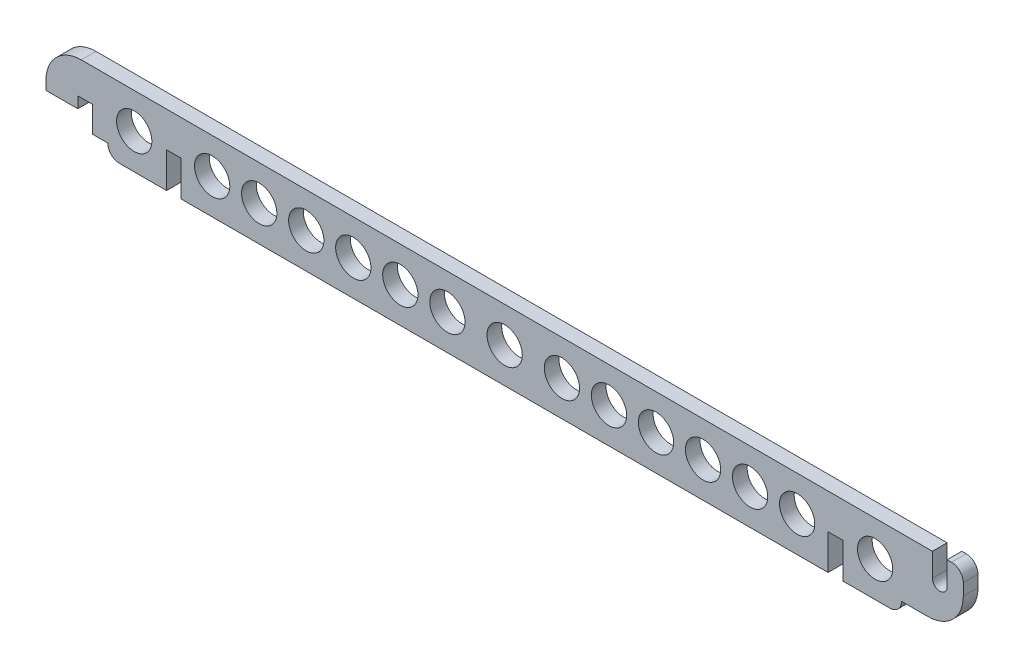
ISO-10303-21;
HEADER;
FILE_DESCRIPTION(('STEP AP214'),'2;1');
FILE_NAME('part.step','',(''),(''),'','','');
FILE_SCHEMA(('AUTOMOTIVE_DESIGN { 1 0 10303 214 1 1 1 1 }'));
ENDSEC;
DATA;
#1=APPLICATION_CONTEXT('core data for automotive mechanical design processes');
#2=APPLICATION_PROTOCOL_DEFINITION('international standard','automotive_design',2000,#1);
#3=PRODUCT_CONTEXT('',#1,'mechanical');
#4=PRODUCT('Part','Part','',(#3));
#5=PRODUCT_RELATED_PRODUCT_CATEGORY('part','',(#4));
#6=PRODUCT_DEFINITION_FORMATION('','',#4);
#7=PRODUCT_DEFINITION_CONTEXT('part definition',#1,'design');
#8=PRODUCT_DEFINITION('design','',#6,#7);
#9=PRODUCT_DEFINITION_SHAPE('','',#8);
#10=(LENGTH_UNIT() NAMED_UNIT(*) SI_UNIT(.MILLI.,.METRE.));
#11=(NAMED_UNIT(*) PLANE_ANGLE_UNIT() SI_UNIT($,.RADIAN.));
#12=(NAMED_UNIT(*) SI_UNIT($,.STERADIAN.) SOLID_ANGLE_UNIT());
#13=UNCERTAINTY_MEASURE_WITH_UNIT(LENGTH_MEASURE(1.E-05),#10,'distance_accuracy_value','');
#14=(GEOMETRIC_REPRESENTATION_CONTEXT(3) GLOBAL_UNCERTAINTY_ASSIGNED_CONTEXT((#13)) GLOBAL_UNIT_ASSIGNED_CONTEXT((#10,
#11,#12)) REPRESENTATION_CONTEXT('',''));
#15=CARTESIAN_POINT('',(0.,0.,0.));
#16=DIRECTION('',(0.,0.,1.));
#17=DIRECTION('',(1.,0.,0.));
#18=AXIS2_PLACEMENT_3D('',#15,#16,#17);
#19=CARTESIAN_POINT('',(-177.025859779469,26.2786282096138,3.175));
#20=DIRECTION('',(0.,0.,1.));
#21=DIRECTION('',(1.,0.,0.));
#22=AXIS2_PLACEMENT_3D('',#19,#20,#21);
#23=PLANE('',#22);
#24=CARTESIAN_POINT('',(-5.57602117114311,26.2786282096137,3.175));
#25=DIRECTION('',(0.,0.,1.));
#26=DIRECTION('',(-1.,0.,0.));
#27=AXIS2_PLACEMENT_3D('',#24,#25,#26);
#28=CIRCLE('',#27,3.81000000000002);
#29=CARTESIAN_POINT('',(-9.38602117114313,26.2786282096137,3.175));
#30=VERTEX_POINT('',#29);
#31=EDGE_CURVE('E529',#30,#30,#28,.T.);
#32=ORIENTED_EDGE('',*,*,#31,.F.);
#33=EDGE_LOOP('',(#32));
#34=FACE_BOUND('',#33,.T.);
#35=CARTESIAN_POINT('',(-32.574572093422,26.2786282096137,3.175));
#36=DIRECTION('',(0.,0.,1.));
#37=DIRECTION('',(-1.,0.,0.));
#38=AXIS2_PLACEMENT_3D('',#35,#36,#37);
#39=CIRCLE('',#38,3.81000000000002);
#40=CARTESIAN_POINT('',(-36.384572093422,26.2786282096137,3.175));
#41=VERTEX_POINT('',#40);
#42=EDGE_CURVE('E541',#41,#41,#39,.T.);
#43=ORIENTED_EDGE('',*,*,#42,.F.);
#44=EDGE_LOOP('',(#43));
#45=FACE_BOUND('',#44,.T.);
#46=CARTESIAN_POINT('',(-52.894572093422,26.2786282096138,3.175));
#47=DIRECTION('',(0.,0.,1.));
#48=DIRECTION('',(-1.,0.,0.));
#49=AXIS2_PLACEMENT_3D('',#46,#47,#48);
#50=CIRCLE('',#49,3.81);
#51=CARTESIAN_POINT('',(-56.704572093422,26.2786282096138,3.175));
#52=VERTEX_POINT('',#51);
#53=EDGE_CURVE('E553',#52,#52,#50,.T.);
#54=ORIENTED_EDGE('',*,*,#53,.F.);
#55=EDGE_LOOP('',(#54));
#56=FACE_BOUND('',#55,.T.);
#57=CARTESIAN_POINT('',(-97.9571474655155,26.2786282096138,3.175));
#58=DIRECTION('',(0.,0.,1.));
#59=DIRECTION('',(1.,0.,0.));
#60=AXIS2_PLACEMENT_3D('',#57,#58,#59);
#61=CIRCLE('',#60,3.81);
#62=CARTESIAN_POINT('',(-94.1471474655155,26.2786282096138,3.175));
#63=VERTEX_POINT('',#62);
#64=EDGE_CURVE('E565',#63,#63,#61,.T.);
#65=ORIENTED_EDGE('',*,*,#64,.F.);
#66=EDGE_LOOP('',(#65));
#67=FACE_BOUND('',#66,.T.);
#68=CARTESIAN_POINT('',(-118.277147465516,26.2786282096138,3.175));
#69=DIRECTION('',(0.,0.,1.));
#70=DIRECTION('',(1.,0.,0.));
#71=AXIS2_PLACEMENT_3D('',#68,#69,#70);
#72=CIRCLE('',#71,3.80999999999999);
#73=CARTESIAN_POINT('',(-114.467147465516,26.2786282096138,3.175));
#74=VERTEX_POINT('',#73);
#75=EDGE_CURVE('E577',#74,#74,#72,.T.);
#76=ORIENTED_EDGE('',*,*,#75,.F.);
#77=EDGE_LOOP('',(#76));
#78=FACE_BOUND('',#77,.T.);
#79=CARTESIAN_POINT('',(-138.597147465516,26.2786282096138,3.175));
#80=DIRECTION('',(0.,0.,1.));
#81=DIRECTION('',(1.,0.,0.));
#82=AXIS2_PLACEMENT_3D('',#79,#80,#81);
#83=CIRCLE('',#82,3.81000000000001);
#84=CARTESIAN_POINT('',(-134.787147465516,26.2786282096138,3.175));
#85=VERTEX_POINT('',#84);
#86=EDGE_CURVE('E589',#85,#85,#83,.T.);
#87=ORIENTED_EDGE('',*,*,#86,.F.);
#88=EDGE_LOOP('',(#87));
#89=FACE_BOUND('',#88,.T.);
#90=CARTESIAN_POINT('',(-73.214572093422,26.2786282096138,3.175));
#91=DIRECTION('',(0.,0.,1.));
#92=DIRECTION('',(-1.,0.,0.));
#93=AXIS2_PLACEMENT_3D('',#90,#91,#92);
#94=CIRCLE('',#93,3.81);
#95=CARTESIAN_POINT('',(-77.024572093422,26.2786282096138,3.175));
#96=VERTEX_POINT('',#95);
#97=EDGE_CURVE('E601',#96,#96,#94,.T.);
#98=ORIENTED_EDGE('',*,*,#97,.F.);
#99=EDGE_LOOP('',(#98));
#100=FACE_BOUND('',#99,.T.);
#101=CARTESIAN_POINT('',(-177.025859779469,26.2786282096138,3.175));
#102=DIRECTION('',(0.,0.,1.));
#103=DIRECTION('',(1.,0.,0.));
#104=AXIS2_PLACEMENT_3D('',#101,#102,#103);
#105=CIRCLE('',#104,7.61999999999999);
#106=CARTESIAN_POINT('',(-177.025859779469,33.8986282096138,3.175));
#107=VERTEX_POINT('',#106);
#108=CARTESIAN_POINT('',(-184.645859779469,26.2786282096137,3.175));
#109=VERTEX_POINT('',#108);
#110=EDGE_CURVE('E295',#107,#109,#105,.T.);
#111=ORIENTED_EDGE('',*,*,#110,.T.);
#112=DIRECTION('',(0.,-1.,0.));
#113=VECTOR('',#112,1.);
#114=CARTESIAN_POINT('',(-184.645859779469,24.3736282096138,3.175));
#115=LINE('',#114,#113);
#116=CARTESIAN_POINT('',(-184.645859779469,24.3736282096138,3.175));
#117=VERTEX_POINT('',#116);
#118=EDGE_CURVE('E148',#109,#117,#115,.T.);
#119=ORIENTED_EDGE('',*,*,#118,.T.);
#120=DIRECTION('',(1.,0.,0.));
#121=VECTOR('',#120,1.);
#122=CARTESIAN_POINT('',(-177.787859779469,24.3736282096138,3.175));
#123=LINE('',#122,#121);
#124=CARTESIAN_POINT('',(-177.787859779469,24.3736282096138,3.175));
#125=VERTEX_POINT('',#124);
#126=EDGE_CURVE('E367',#117,#125,#123,.T.);
#127=ORIENTED_EDGE('',*,*,#126,.T.);
#128=DIRECTION('',(0.,1.,0.));
#129=VECTOR('',#128,1.);
#130=CARTESIAN_POINT('',(-177.787859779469,24.3736282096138,3.175));
#131=LINE('',#130,#129);
#132=CARTESIAN_POINT('',(-177.787859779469,26.7990639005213,3.175));
#133=VERTEX_POINT('',#132);
#134=EDGE_CURVE('E386',#125,#133,#131,.T.);
#135=ORIENTED_EDGE('',*,*,#134,.T.);
#136=DIRECTION('',(1.,0.,0.));
#137=VECTOR('',#136,1.);
#138=CARTESIAN_POINT('',(-177.787859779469,26.7990639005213,3.175));
#139=LINE('',#138,#137);
#140=CARTESIAN_POINT('',(-174.612859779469,26.7990639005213,3.175));
#141=VERTEX_POINT('',#140);
#142=EDGE_CURVE('E383',#133,#141,#139,.T.);
#143=ORIENTED_EDGE('',*,*,#142,.T.);
#144=DIRECTION('',(0.,-1.,0.));
#145=VECTOR('',#144,1.);
#146=CARTESIAN_POINT('',(-174.612859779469,26.7990639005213,3.175));
#147=LINE('',#146,#145);
#148=CARTESIAN_POINT('',(-174.612859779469,21.1986282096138,3.175));
#149=VERTEX_POINT('',#148);
#150=EDGE_CURVE('E385',#141,#149,#147,.T.);
#151=ORIENTED_EDGE('',*,*,#150,.T.);
#152=DIRECTION('',(1.,0.,0.));
#153=VECTOR('',#152,1.);
#154=CARTESIAN_POINT('',(-171.310859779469,21.1986282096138,3.175));
#155=LINE('',#154,#153);
#156=CARTESIAN_POINT('',(-171.310859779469,21.1986282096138,3.175));
#157=VERTEX_POINT('',#156);
#158=EDGE_CURVE('E388',#149,#157,#155,.T.);
#159=ORIENTED_EDGE('',*,*,#158,.T.);
#160=CARTESIAN_POINT('',(-168.770859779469,21.1986282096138,3.175));
#161=DIRECTION('',(0.,0.,1.));
#162=DIRECTION('',(1.,0.,0.));
#163=AXIS2_PLACEMENT_3D('',#160,#161,#162);
#164=CIRCLE('',#163,2.53999999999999);
#165=CARTESIAN_POINT('',(-168.770859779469,18.6586282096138,3.175));
#166=VERTEX_POINT('',#165);
#167=EDGE_CURVE('E394',#157,#166,#164,.T.);
#168=ORIENTED_EDGE('',*,*,#167,.T.);
#169=DIRECTION('',(1.,0.,0.));
#170=VECTOR('',#169,1.);
#171=CARTESIAN_POINT('',(-158.610859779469,18.6586282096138,3.175));
#172=LINE('',#171,#170);
#173=CARTESIAN_POINT('',(-158.610859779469,18.6586282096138,3.175));
#174=VERTEX_POINT('',#173);
#175=EDGE_CURVE('E396',#166,#174,#172,.T.);
#176=ORIENTED_EDGE('',*,*,#175,.T.);
#177=DIRECTION('',(0.,1.,0.));
#178=VECTOR('',#177,1.);
#179=CARTESIAN_POINT('',(-158.610859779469,26.2786282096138,3.175));
#180=LINE('',#179,#178);
#181=CARTESIAN_POINT('',(-158.610859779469,26.2786282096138,3.175));
#182=VERTEX_POINT('',#181);
#183=EDGE_CURVE('E398',#174,#182,#180,.T.);
#184=ORIENTED_EDGE('',*,*,#183,.T.);
#185=DIRECTION('',(1.,0.,0.));
#186=VECTOR('',#185,1.);
#187=CARTESIAN_POINT('',(-155.435859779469,26.2786282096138,3.175));
#188=LINE('',#187,#186);
#189=CARTESIAN_POINT('',(-155.435859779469,26.2786282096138,3.175));
#190=VERTEX_POINT('',#189);
#191=EDGE_CURVE('E400',#182,#190,#188,.T.);
#192=ORIENTED_EDGE('',*,*,#191,.T.);
#193=DIRECTION('',(1.45698559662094E-13,-1.,0.));
#194=VECTOR('',#193,1.);
#195=CARTESIAN_POINT('',(-155.435859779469,26.2786282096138,3.175));
#196=LINE('',#195,#194);
#197=CARTESIAN_POINT('',(-155.435859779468,18.6586282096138,3.175));
#198=VERTEX_POINT('',#197);
#199=EDGE_CURVE('E402',#190,#198,#196,.T.);
#200=ORIENTED_EDGE('',*,*,#199,.T.);
#201=DIRECTION('',(1.,0.,0.));
#202=VECTOR('',#201,1.);
#203=CARTESIAN_POINT('',(-15.7358597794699,18.6586282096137,3.175));
#204=LINE('',#203,#202);
#205=CARTESIAN_POINT('',(-15.7358597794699,18.6586282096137,3.175));
#206=VERTEX_POINT('',#205);
#207=EDGE_CURVE('E404',#198,#206,#204,.T.);
#208=ORIENTED_EDGE('',*,*,#207,.T.);
#209=DIRECTION('',(1.45698559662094E-13,1.,0.));
#210=VECTOR('',#209,1.);
#211=CARTESIAN_POINT('',(-15.7358597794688,26.2786282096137,3.175));
#212=LINE('',#211,#210);
#213=CARTESIAN_POINT('',(-15.7358597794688,26.2786282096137,3.175));
#214=VERTEX_POINT('',#213);
#215=EDGE_CURVE('E406',#206,#214,#212,.T.);
#216=ORIENTED_EDGE('',*,*,#215,.T.);
#217=DIRECTION('',(1.,0.,0.));
#218=VECTOR('',#217,1.);
#219=CARTESIAN_POINT('',(-15.7358597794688,26.2786282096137,3.175));
#220=LINE('',#219,#218);
#221=CARTESIAN_POINT('',(-12.5608597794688,26.2786282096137,3.175));
#222=VERTEX_POINT('',#221);
#223=EDGE_CURVE('E408',#214,#222,#220,.T.);
#224=ORIENTED_EDGE('',*,*,#223,.T.);
#225=DIRECTION('',(0.,-1.,0.));
#226=VECTOR('',#225,1.);
#227=CARTESIAN_POINT('',(-12.5608597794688,26.2786282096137,3.175));
#228=LINE('',#227,#226);
#229=CARTESIAN_POINT('',(-12.5608597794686,18.6586282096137,3.175));
#230=VERTEX_POINT('',#229);
#231=EDGE_CURVE('E410',#222,#230,#228,.T.);
#232=ORIENTED_EDGE('',*,*,#231,.T.);
#233=DIRECTION('',(1.,0.,0.));
#234=VECTOR('',#233,1.);
#235=CARTESIAN_POINT('',(-12.5608597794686,18.6586282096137,3.175));
#236=LINE('',#235,#234);
#237=CARTESIAN_POINT('',(-2.40085977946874,18.6586282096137,3.175));
#238=VERTEX_POINT('',#237);
#239=EDGE_CURVE('E412',#230,#238,#236,.T.);
#240=ORIENTED_EDGE('',*,*,#239,.T.);
#241=CARTESIAN_POINT('',(-2.40085977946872,21.1986282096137,3.175));
#242=DIRECTION('',(0.,0.,1.));
#243=DIRECTION('',(-1.,0.,0.));
#244=AXIS2_PLACEMENT_3D('',#241,#242,#243);
#245=CIRCLE('',#244,2.53999999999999);
#246=CARTESIAN_POINT('',(0.13914022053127,21.1986282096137,3.175));
#247=VERTEX_POINT('',#246);
#248=EDGE_CURVE('E414',#238,#247,#245,.T.);
#249=ORIENTED_EDGE('',*,*,#248,.T.);
#250=DIRECTION('',(1.,0.,0.));
#251=VECTOR('',#250,1.);
#252=CARTESIAN_POINT('',(0.13914022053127,21.1986282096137,3.175));
#253=LINE('',#252,#251);
#254=CARTESIAN_POINT('',(5.85414022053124,21.1986282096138,3.175));
#255=VERTEX_POINT('',#254);
#256=EDGE_CURVE('E416',#247,#255,#253,.T.);
#257=ORIENTED_EDGE('',*,*,#256,.T.);
#258=CARTESIAN_POINT('',(5.8541402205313,28.8186282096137,3.175));
#259=DIRECTION('',(0.,0.,1.));
#260=DIRECTION('',(1.,0.,0.));
#261=AXIS2_PLACEMENT_3D('',#258,#259,#260);
#262=CIRCLE('',#261,7.61999999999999);
#263=CARTESIAN_POINT('',(13.4741402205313,28.8186282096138,3.175));
#264=VERTEX_POINT('',#263);
#265=EDGE_CURVE('E418',#255,#264,#262,.T.);
#266=ORIENTED_EDGE('',*,*,#265,.T.);
#267=DIRECTION('',(0.,1.,0.));
#268=VECTOR('',#267,1.);
#269=CARTESIAN_POINT('',(13.4741402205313,28.8186282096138,3.175));
#270=LINE('',#269,#268);
#271=CARTESIAN_POINT('',(13.4741402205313,31.3586282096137,3.175));
#272=VERTEX_POINT('',#271);
#273=EDGE_CURVE('E420',#264,#272,#270,.T.);
#274=ORIENTED_EDGE('',*,*,#273,.T.);
#275=CARTESIAN_POINT('',(10.9341402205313,31.3586282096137,3.175));
#276=DIRECTION('',(0.,0.,1.));
#277=DIRECTION('',(-1.,0.,0.));
#278=AXIS2_PLACEMENT_3D('',#275,#276,#277);
#279=CIRCLE('',#278,2.54);
#280=CARTESIAN_POINT('',(10.9341402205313,33.8986282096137,3.175));
#281=VERTEX_POINT('',#280);
#282=EDGE_CURVE('E422',#272,#281,#279,.T.);
#283=ORIENTED_EDGE('',*,*,#282,.T.);
#284=DIRECTION('',(-1.,0.,0.));
#285=VECTOR('',#284,1.);
#286=CARTESIAN_POINT('',(10.9341402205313,33.8986282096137,3.175));
#287=LINE('',#286,#285);
#288=CARTESIAN_POINT('',(9.98164022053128,33.8986282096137,3.175));
#289=VERTEX_POINT('',#288);
#290=EDGE_CURVE('E424',#281,#289,#287,.T.);
#291=ORIENTED_EDGE('',*,*,#290,.T.);
#292=DIRECTION('',(0.,-1.,0.));
#293=VECTOR('',#292,1.);
#294=CARTESIAN_POINT('',(9.98164022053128,33.8986282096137,3.175));
#295=LINE('',#294,#293);
#296=CARTESIAN_POINT('',(9.98164022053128,28.8186282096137,3.175));
#297=VERTEX_POINT('',#296);
#298=EDGE_CURVE('E224',#289,#297,#295,.T.);
#299=ORIENTED_EDGE('',*,*,#298,.T.);
#300=CARTESIAN_POINT('',(8.39414022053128,28.8186282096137,3.175));
#301=DIRECTION('',(0.,0.,-1.));
#302=DIRECTION('',(1.,0.,0.));
#303=AXIS2_PLACEMENT_3D('',#300,#301,#302);
#304=CIRCLE('',#303,1.5875);
#305=CARTESIAN_POINT('',(6.80664022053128,28.8186282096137,3.175));
#306=VERTEX_POINT('',#305);
#307=EDGE_CURVE('E218',#297,#306,#304,.T.);
#308=ORIENTED_EDGE('',*,*,#307,.T.);
#309=DIRECTION('',(0.,1.,0.));
#310=VECTOR('',#309,1.);
#311=CARTESIAN_POINT('',(6.80664022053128,33.8986282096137,3.175));
#312=LINE('',#311,#310);
#313=CARTESIAN_POINT('',(6.80664022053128,33.8986282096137,3.175));
#314=VERTEX_POINT('',#313);
#315=EDGE_CURVE('E222',#306,#314,#312,.T.);
#316=ORIENTED_EDGE('',*,*,#315,.T.);
#317=DIRECTION('',(-1.,0.,0.));
#318=VECTOR('',#317,1.);
#319=CARTESIAN_POINT('',(6.80664022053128,33.8986282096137,3.175));
#320=LINE('',#319,#318);
#321=EDGE_CURVE('E48',#314,#107,#320,.T.);
#322=ORIENTED_EDGE('',*,*,#321,.T.);
#323=EDGE_LOOP('',(#111,#119,#127,#135,#143,#151,#159,#168,#176,#184,#192,#200,#208,#216,#224,
#232,#240,#249,#257,#266,#274,#283,#291,#299,#308,#316,#322));
#324=FACE_BOUND('',#323,.T.);
#325=CARTESIAN_POINT('',(-165.595698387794,26.2786282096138,3.175));
#326=DIRECTION('',(0.,0.,1.));
#327=DIRECTION('',(1.,0.,0.));
#328=AXIS2_PLACEMENT_3D('',#325,#326,#327);
#329=CIRCLE('',#328,3.81000000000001);
#330=CARTESIAN_POINT('',(-161.785698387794,26.2786282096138,3.175));
#331=VERTEX_POINT('',#330);
#332=EDGE_CURVE('E246',#331,#331,#329,.T.);
#333=ORIENTED_EDGE('',*,*,#332,.F.);
#334=EDGE_LOOP('',(#333));
#335=FACE_BOUND('',#334,.T.);
#336=CARTESIAN_POINT('',(-148.757147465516,26.2786282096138,3.175));
#337=DIRECTION('',(0.,0.,1.));
#338=DIRECTION('',(1.,0.,0.));
#339=AXIS2_PLACEMENT_3D('',#336,#337,#338);
#340=CIRCLE('',#339,3.81000000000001);
#341=CARTESIAN_POINT('',(-144.947147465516,26.2786282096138,3.175));
#342=VERTEX_POINT('',#341);
#343=EDGE_CURVE('E595',#342,#342,#340,.T.);
#344=ORIENTED_EDGE('',*,*,#343,.F.);
#345=EDGE_LOOP('',(#344));
#346=FACE_BOUND('',#345,.T.);
#347=CARTESIAN_POINT('',(-128.437147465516,26.2786282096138,3.175));
#348=DIRECTION('',(0.,0.,1.));
#349=DIRECTION('',(1.,0.,0.));
#350=AXIS2_PLACEMENT_3D('',#347,#348,#349);
#351=CIRCLE('',#350,3.81000000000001);
#352=CARTESIAN_POINT('',(-124.627147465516,26.2786282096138,3.175));
#353=VERTEX_POINT('',#352);
#354=EDGE_CURVE('E583',#353,#353,#351,.T.);
#355=ORIENTED_EDGE('',*,*,#354,.F.);
#356=EDGE_LOOP('',(#355));
#357=FACE_BOUND('',#356,.T.);
#358=CARTESIAN_POINT('',(-108.117147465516,26.2786282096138,3.175));
#359=DIRECTION('',(0.,0.,1.));
#360=DIRECTION('',(1.,0.,0.));
#361=AXIS2_PLACEMENT_3D('',#358,#359,#360);
#362=CIRCLE('',#361,3.81);
#363=CARTESIAN_POINT('',(-104.307147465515,26.2786282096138,3.175));
#364=VERTEX_POINT('',#363);
#365=EDGE_CURVE('E571',#364,#364,#362,.T.);
#366=ORIENTED_EDGE('',*,*,#365,.F.);
#367=EDGE_LOOP('',(#366));
#368=FACE_BOUND('',#367,.T.);
#369=CARTESIAN_POINT('',(-63.054572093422,26.2786282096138,3.175));
#370=DIRECTION('',(0.,0.,1.));
#371=DIRECTION('',(-1.,0.,0.));
#372=AXIS2_PLACEMENT_3D('',#369,#370,#371);
#373=CIRCLE('',#372,3.81000000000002);
#374=CARTESIAN_POINT('',(-66.864572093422,26.2786282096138,3.175));
#375=VERTEX_POINT('',#374);
#376=EDGE_CURVE('E559',#375,#375,#373,.T.);
#377=ORIENTED_EDGE('',*,*,#376,.F.);
#378=EDGE_LOOP('',(#377));
#379=FACE_BOUND('',#378,.T.);
#380=CARTESIAN_POINT('',(-42.734572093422,26.2786282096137,3.175));
#381=DIRECTION('',(0.,0.,1.));
#382=DIRECTION('',(-1.,0.,0.));
#383=AXIS2_PLACEMENT_3D('',#380,#381,#382);
#384=CIRCLE('',#383,3.81000000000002);
#385=CARTESIAN_POINT('',(-46.544572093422,26.2786282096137,3.175));
#386=VERTEX_POINT('',#385);
#387=EDGE_CURVE('E547',#386,#386,#384,.T.);
#388=ORIENTED_EDGE('',*,*,#387,.F.);
#389=EDGE_LOOP('',(#388));
#390=FACE_BOUND('',#389,.T.);
#391=CARTESIAN_POINT('',(-22.414572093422,26.2786282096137,3.175));
#392=DIRECTION('',(0.,0.,1.));
#393=DIRECTION('',(-1.,0.,0.));
#394=AXIS2_PLACEMENT_3D('',#391,#392,#393);
#395=CIRCLE('',#394,3.81000000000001);
#396=CARTESIAN_POINT('',(-26.224572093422,26.2786282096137,3.175));
#397=VERTEX_POINT('',#396);
#398=EDGE_CURVE('E535',#397,#397,#395,.T.);
#399=ORIENTED_EDGE('',*,*,#398,.F.);
#400=EDGE_LOOP('',(#399));
#401=FACE_BOUND('',#400,.T.);
#402=CARTESIAN_POINT('',(-85.5858597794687,26.2786282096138,3.175));
#403=DIRECTION('',(0.,0.,1.));
#404=DIRECTION('',(1.,0.,0.));
#405=AXIS2_PLACEMENT_3D('',#402,#403,#404);
#406=CIRCLE('',#405,3.81);
#407=CARTESIAN_POINT('',(-81.7758597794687,26.2786282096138,3.175));
#408=VERTEX_POINT('',#407);
#409=EDGE_CURVE('E520',#408,#408,#406,.T.);
#410=ORIENTED_EDGE('',*,*,#409,.F.);
#411=EDGE_LOOP('',(#410));
#412=FACE_BOUND('',#411,.T.);
#413=ADVANCED_FACE('F31',(#34,#45,#56,#67,#78,#89,#100,#324,#335,#346,#357,#368,#379,#390,#401,
#412),#23,.T.);
#414=CARTESIAN_POINT('',(-177.025859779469,26.2786282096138,0.));
#415=DIRECTION('',(0.,0.,1.));
#416=DIRECTION('',(1.,0.,0.));
#417=AXIS2_PLACEMENT_3D('',#414,#415,#416);
#418=PLANE('',#417);
#419=CARTESIAN_POINT('',(-5.57602117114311,26.2786282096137,0.));
#420=DIRECTION('',(0.,0.,1.));
#421=DIRECTION('',(-1.,0.,0.));
#422=AXIS2_PLACEMENT_3D('',#419,#420,#421);
#423=CIRCLE('',#422,3.81000000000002);
#424=CARTESIAN_POINT('',(-9.38602117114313,26.2786282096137,0.));
#425=VERTEX_POINT('',#424);
#426=EDGE_CURVE('E526',#425,#425,#423,.T.);
#427=ORIENTED_EDGE('',*,*,#426,.T.);
#428=EDGE_LOOP('',(#427));
#429=FACE_BOUND('',#428,.T.);
#430=CARTESIAN_POINT('',(-32.574572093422,26.2786282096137,0.));
#431=DIRECTION('',(0.,0.,1.));
#432=DIRECTION('',(-1.,0.,0.));
#433=AXIS2_PLACEMENT_3D('',#430,#431,#432);
#434=CIRCLE('',#433,3.81000000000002);
#435=CARTESIAN_POINT('',(-36.384572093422,26.2786282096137,0.));
#436=VERTEX_POINT('',#435);
#437=EDGE_CURVE('E538',#436,#436,#434,.T.);
#438=ORIENTED_EDGE('',*,*,#437,.T.);
#439=EDGE_LOOP('',(#438));
#440=FACE_BOUND('',#439,.T.);
#441=CARTESIAN_POINT('',(-52.894572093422,26.2786282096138,0.));
#442=DIRECTION('',(0.,0.,1.));
#443=DIRECTION('',(-1.,0.,0.));
#444=AXIS2_PLACEMENT_3D('',#441,#442,#443);
#445=CIRCLE('',#444,3.81);
#446=CARTESIAN_POINT('',(-56.704572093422,26.2786282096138,0.));
#447=VERTEX_POINT('',#446);
#448=EDGE_CURVE('E550',#447,#447,#445,.T.);
#449=ORIENTED_EDGE('',*,*,#448,.T.);
#450=EDGE_LOOP('',(#449));
#451=FACE_BOUND('',#450,.T.);
#452=CARTESIAN_POINT('',(-97.9571474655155,26.2786282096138,0.));
#453=DIRECTION('',(0.,0.,1.));
#454=DIRECTION('',(1.,0.,0.));
#455=AXIS2_PLACEMENT_3D('',#452,#453,#454);
#456=CIRCLE('',#455,3.81);
#457=CARTESIAN_POINT('',(-94.1471474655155,26.2786282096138,0.));
#458=VERTEX_POINT('',#457);
#459=EDGE_CURVE('E562',#458,#458,#456,.T.);
#460=ORIENTED_EDGE('',*,*,#459,.T.);
#461=EDGE_LOOP('',(#460));
#462=FACE_BOUND('',#461,.T.);
#463=CARTESIAN_POINT('',(-118.277147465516,26.2786282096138,0.));
#464=DIRECTION('',(0.,0.,1.));
#465=DIRECTION('',(1.,0.,0.));
#466=AXIS2_PLACEMENT_3D('',#463,#464,#465);
#467=CIRCLE('',#466,3.80999999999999);
#468=CARTESIAN_POINT('',(-114.467147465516,26.2786282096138,0.));
#469=VERTEX_POINT('',#468);
#470=EDGE_CURVE('E574',#469,#469,#467,.T.);
#471=ORIENTED_EDGE('',*,*,#470,.T.);
#472=EDGE_LOOP('',(#471));
#473=FACE_BOUND('',#472,.T.);
#474=CARTESIAN_POINT('',(-138.597147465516,26.2786282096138,0.));
#475=DIRECTION('',(0.,0.,1.));
#476=DIRECTION('',(1.,0.,0.));
#477=AXIS2_PLACEMENT_3D('',#474,#475,#476);
#478=CIRCLE('',#477,3.81000000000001);
#479=CARTESIAN_POINT('',(-134.787147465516,26.2786282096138,0.));
#480=VERTEX_POINT('',#479);
#481=EDGE_CURVE('E586',#480,#480,#478,.T.);
#482=ORIENTED_EDGE('',*,*,#481,.T.);
#483=EDGE_LOOP('',(#482));
#484=FACE_BOUND('',#483,.T.);
#485=CARTESIAN_POINT('',(-73.214572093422,26.2786282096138,0.));
#486=DIRECTION('',(0.,0.,1.));
#487=DIRECTION('',(-1.,0.,0.));
#488=AXIS2_PLACEMENT_3D('',#485,#486,#487);
#489=CIRCLE('',#488,3.81);
#490=CARTESIAN_POINT('',(-77.024572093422,26.2786282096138,0.));
#491=VERTEX_POINT('',#490);
#492=EDGE_CURVE('E598',#491,#491,#489,.T.);
#493=ORIENTED_EDGE('',*,*,#492,.T.);
#494=EDGE_LOOP('',(#493));
#495=FACE_BOUND('',#494,.T.);
#496=CARTESIAN_POINT('',(-177.025859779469,26.2786282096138,0.));
#497=DIRECTION('',(0.,0.,1.));
#498=DIRECTION('',(1.,0.,0.));
#499=AXIS2_PLACEMENT_3D('',#496,#497,#498);
#500=CIRCLE('',#499,7.61999999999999);
#501=CARTESIAN_POINT('',(-177.025859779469,33.8986282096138,0.));
#502=VERTEX_POINT('',#501);
#503=CARTESIAN_POINT('',(-184.645859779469,26.2786282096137,0.));
#504=VERTEX_POINT('',#503);
#505=EDGE_CURVE('E242',#502,#504,#500,.T.);
#506=ORIENTED_EDGE('',*,*,#505,.F.);
#507=DIRECTION('',(-1.,0.,0.));
#508=VECTOR('',#507,1.);
#509=CARTESIAN_POINT('',(6.80664022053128,33.8986282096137,0.));
#510=LINE('',#509,#508);
#511=CARTESIAN_POINT('',(6.80664022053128,33.8986282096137,0.));
#512=VERTEX_POINT('',#511);
#513=EDGE_CURVE('E140',#512,#502,#510,.T.);
#514=ORIENTED_EDGE('',*,*,#513,.F.);
#515=DIRECTION('',(0.,1.,0.));
#516=VECTOR('',#515,1.);
#517=CARTESIAN_POINT('',(6.80664022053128,33.8986282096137,0.));
#518=LINE('',#517,#516);
#519=CARTESIAN_POINT('',(6.80664022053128,28.8186282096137,0.));
#520=VERTEX_POINT('',#519);
#521=EDGE_CURVE('E134',#520,#512,#518,.T.);
#522=ORIENTED_EDGE('',*,*,#521,.F.);
#523=CARTESIAN_POINT('',(8.39414022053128,28.8186282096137,0.));
#524=DIRECTION('',(0.,0.,-1.));
#525=DIRECTION('',(1.,0.,0.));
#526=AXIS2_PLACEMENT_3D('',#523,#524,#525);
#527=CIRCLE('',#526,1.5875);
#528=CARTESIAN_POINT('',(9.98164022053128,28.8186282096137,0.));
#529=VERTEX_POINT('',#528);
#530=EDGE_CURVE('E232',#529,#520,#527,.T.);
#531=ORIENTED_EDGE('',*,*,#530,.F.);
#532=DIRECTION('',(0.,-1.,0.));
#533=VECTOR('',#532,1.);
#534=CARTESIAN_POINT('',(9.98164022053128,33.8986282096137,0.));
#535=LINE('',#534,#533);
#536=CARTESIAN_POINT('',(9.98164022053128,33.8986282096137,0.));
#537=VERTEX_POINT('',#536);
#538=EDGE_CURVE('E290',#537,#529,#535,.T.);
#539=ORIENTED_EDGE('',*,*,#538,.F.);
#540=DIRECTION('',(-1.,0.,0.));
#541=VECTOR('',#540,1.);
#542=CARTESIAN_POINT('',(10.9341402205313,33.8986282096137,0.));
#543=LINE('',#542,#541);
#544=CARTESIAN_POINT('',(10.9341402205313,33.8986282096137,0.));
#545=VERTEX_POINT('',#544);
#546=EDGE_CURVE('E288',#545,#537,#543,.T.);
#547=ORIENTED_EDGE('',*,*,#546,.F.);
#548=CARTESIAN_POINT('',(10.9341402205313,31.3586282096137,0.));
#549=DIRECTION('',(0.,0.,1.));
#550=DIRECTION('',(-1.,0.,0.));
#551=AXIS2_PLACEMENT_3D('',#548,#549,#550);
#552=CIRCLE('',#551,2.54);
#553=CARTESIAN_POINT('',(13.4741402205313,31.3586282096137,0.));
#554=VERTEX_POINT('',#553);
#555=EDGE_CURVE('E286',#554,#545,#552,.T.);
#556=ORIENTED_EDGE('',*,*,#555,.F.);
#557=DIRECTION('',(0.,1.,0.));
#558=VECTOR('',#557,1.);
#559=CARTESIAN_POINT('',(13.4741402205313,28.8186282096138,0.));
#560=LINE('',#559,#558);
#561=CARTESIAN_POINT('',(13.4741402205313,28.8186282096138,0.));
#562=VERTEX_POINT('',#561);
#563=EDGE_CURVE('E284',#562,#554,#560,.T.);
#564=ORIENTED_EDGE('',*,*,#563,.F.);
#565=CARTESIAN_POINT('',(5.8541402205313,28.8186282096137,0.));
#566=DIRECTION('',(0.,0.,1.));
#567=DIRECTION('',(1.,0.,0.));
#568=AXIS2_PLACEMENT_3D('',#565,#566,#567);
#569=CIRCLE('',#568,7.61999999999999);
#570=CARTESIAN_POINT('',(5.85414022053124,21.1986282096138,0.));
#571=VERTEX_POINT('',#570);
#572=EDGE_CURVE('E282',#571,#562,#569,.T.);
#573=ORIENTED_EDGE('',*,*,#572,.F.);
#574=DIRECTION('',(1.,0.,0.));
#575=VECTOR('',#574,1.);
#576=CARTESIAN_POINT('',(0.13914022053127,21.1986282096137,0.));
#577=LINE('',#576,#575);
#578=CARTESIAN_POINT('',(0.13914022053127,21.1986282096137,0.));
#579=VERTEX_POINT('',#578);
#580=EDGE_CURVE('E280',#579,#571,#577,.T.);
#581=ORIENTED_EDGE('',*,*,#580,.F.);
#582=CARTESIAN_POINT('',(-2.40085977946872,21.1986282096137,0.));
#583=DIRECTION('',(0.,0.,1.));
#584=DIRECTION('',(-1.,0.,0.));
#585=AXIS2_PLACEMENT_3D('',#582,#583,#584);
#586=CIRCLE('',#585,2.53999999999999);
#587=CARTESIAN_POINT('',(-2.40085977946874,18.6586282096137,0.));
#588=VERTEX_POINT('',#587);
#589=EDGE_CURVE('E278',#588,#579,#586,.T.);
#590=ORIENTED_EDGE('',*,*,#589,.F.);
#591=DIRECTION('',(1.,0.,0.));
#592=VECTOR('',#591,1.);
#593=CARTESIAN_POINT('',(-12.5608597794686,18.6586282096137,0.));
#594=LINE('',#593,#592);
#595=CARTESIAN_POINT('',(-12.5608597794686,18.6586282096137,0.));
#596=VERTEX_POINT('',#595);
#597=EDGE_CURVE('E276',#596,#588,#594,.T.);
#598=ORIENTED_EDGE('',*,*,#597,.F.);
#599=DIRECTION('',(0.,-1.,0.));
#600=VECTOR('',#599,1.);
#601=CARTESIAN_POINT('',(-12.5608597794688,26.2786282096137,0.));
#602=LINE('',#601,#600);
#603=CARTESIAN_POINT('',(-12.5608597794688,26.2786282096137,0.));
#604=VERTEX_POINT('',#603);
#605=EDGE_CURVE('E274',#604,#596,#602,.T.);
#606=ORIENTED_EDGE('',*,*,#605,.F.);
#607=DIRECTION('',(1.,0.,0.));
#608=VECTOR('',#607,1.);
#609=CARTESIAN_POINT('',(-15.7358597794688,26.2786282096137,0.));
#610=LINE('',#609,#608);
#611=CARTESIAN_POINT('',(-15.7358597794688,26.2786282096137,0.));
#612=VERTEX_POINT('',#611);
#613=EDGE_CURVE('E272',#612,#604,#610,.T.);
#614=ORIENTED_EDGE('',*,*,#613,.F.);
#615=DIRECTION('',(1.45698559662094E-13,1.,0.));
#616=VECTOR('',#615,1.);
#617=CARTESIAN_POINT('',(-15.7358597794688,26.2786282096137,0.));
#618=LINE('',#617,#616);
#619=CARTESIAN_POINT('',(-15.7358597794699,18.6586282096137,0.));
#620=VERTEX_POINT('',#619);
#621=EDGE_CURVE('E270',#620,#612,#618,.T.);
#622=ORIENTED_EDGE('',*,*,#621,.F.);
#623=DIRECTION('',(1.,0.,0.));
#624=VECTOR('',#623,1.);
#625=CARTESIAN_POINT('',(-15.7358597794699,18.6586282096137,0.));
#626=LINE('',#625,#624);
#627=CARTESIAN_POINT('',(-155.435859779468,18.6586282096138,0.));
#628=VERTEX_POINT('',#627);
#629=EDGE_CURVE('E268',#628,#620,#626,.T.);
#630=ORIENTED_EDGE('',*,*,#629,.F.);
#631=DIRECTION('',(1.45698559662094E-13,-1.,0.));
#632=VECTOR('',#631,1.);
#633=CARTESIAN_POINT('',(-155.435859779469,26.2786282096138,0.));
#634=LINE('',#633,#632);
#635=CARTESIAN_POINT('',(-155.435859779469,26.2786282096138,0.));
#636=VERTEX_POINT('',#635);
#637=EDGE_CURVE('E266',#636,#628,#634,.T.);
#638=ORIENTED_EDGE('',*,*,#637,.F.);
#639=DIRECTION('',(1.,0.,0.));
#640=VECTOR('',#639,1.);
#641=CARTESIAN_POINT('',(-155.435859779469,26.2786282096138,0.));
#642=LINE('',#641,#640);
#643=CARTESIAN_POINT('',(-158.610859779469,26.2786282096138,0.));
#644=VERTEX_POINT('',#643);
#645=EDGE_CURVE('E264',#644,#636,#642,.T.);
#646=ORIENTED_EDGE('',*,*,#645,.F.);
#647=DIRECTION('',(0.,1.,0.));
#648=VECTOR('',#647,1.);
#649=CARTESIAN_POINT('',(-158.610859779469,26.2786282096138,0.));
#650=LINE('',#649,#648);
#651=CARTESIAN_POINT('',(-158.610859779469,18.6586282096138,0.));
#652=VERTEX_POINT('',#651);
#653=EDGE_CURVE('E262',#652,#644,#650,.T.);
#654=ORIENTED_EDGE('',*,*,#653,.F.);
#655=DIRECTION('',(1.,0.,0.));
#656=VECTOR('',#655,1.);
#657=CARTESIAN_POINT('',(-158.610859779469,18.6586282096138,0.));
#658=LINE('',#657,#656);
#659=CARTESIAN_POINT('',(-168.770859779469,18.6586282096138,0.));
#660=VERTEX_POINT('',#659);
#661=EDGE_CURVE('E260',#660,#652,#658,.T.);
#662=ORIENTED_EDGE('',*,*,#661,.F.);
#663=CARTESIAN_POINT('',(-168.770859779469,21.1986282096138,0.));
#664=DIRECTION('',(0.,0.,1.));
#665=DIRECTION('',(1.,0.,0.));
#666=AXIS2_PLACEMENT_3D('',#663,#664,#665);
#667=CIRCLE('',#666,2.53999999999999);
#668=CARTESIAN_POINT('',(-171.310859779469,21.1986282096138,0.));
#669=VERTEX_POINT('',#668);
#670=EDGE_CURVE('E258',#669,#660,#667,.T.);
#671=ORIENTED_EDGE('',*,*,#670,.F.);
#672=DIRECTION('',(1.,0.,0.));
#673=VECTOR('',#672,1.);
#674=CARTESIAN_POINT('',(-171.310859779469,21.1986282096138,0.));
#675=LINE('',#674,#673);
#676=CARTESIAN_POINT('',(-174.612859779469,21.1986282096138,0.));
#677=VERTEX_POINT('',#676);
#678=EDGE_CURVE('E256',#677,#669,#675,.T.);
#679=ORIENTED_EDGE('',*,*,#678,.F.);
#680=DIRECTION('',(0.,-1.,0.));
#681=VECTOR('',#680,1.);
#682=CARTESIAN_POINT('',(-174.612859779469,26.7990639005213,0.));
#683=LINE('',#682,#681);
#684=CARTESIAN_POINT('',(-174.612859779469,26.7990639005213,0.));
#685=VERTEX_POINT('',#684);
#686=EDGE_CURVE('E254',#685,#677,#683,.T.);
#687=ORIENTED_EDGE('',*,*,#686,.F.);
#688=DIRECTION('',(1.,0.,0.));
#689=VECTOR('',#688,1.);
#690=CARTESIAN_POINT('',(-177.787859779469,26.7990639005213,0.));
#691=LINE('',#690,#689);
#692=CARTESIAN_POINT('',(-177.787859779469,26.7990639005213,0.));
#693=VERTEX_POINT('',#692);
#694=EDGE_CURVE('E252',#693,#685,#691,.T.);
#695=ORIENTED_EDGE('',*,*,#694,.F.);
#696=DIRECTION('',(0.,1.,0.));
#697=VECTOR('',#696,1.);
#698=CARTESIAN_POINT('',(-177.787859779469,24.3736282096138,0.));
#699=LINE('',#698,#697);
#700=CARTESIAN_POINT('',(-177.787859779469,24.3736282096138,0.));
#701=VERTEX_POINT('',#700);
#702=EDGE_CURVE('E250',#701,#693,#699,.T.);
#703=ORIENTED_EDGE('',*,*,#702,.F.);
#704=DIRECTION('',(1.,0.,0.));
#705=VECTOR('',#704,1.);
#706=CARTESIAN_POINT('',(-177.787859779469,24.3736282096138,0.));
#707=LINE('',#706,#705);
#708=CARTESIAN_POINT('',(-184.645859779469,24.3736282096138,0.));
#709=VERTEX_POINT('',#708);
#710=EDGE_CURVE('E248',#709,#701,#707,.T.);
#711=ORIENTED_EDGE('',*,*,#710,.F.);
#712=DIRECTION('',(0.,-1.,0.));
#713=VECTOR('',#712,1.);
#714=CARTESIAN_POINT('',(-184.645859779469,24.3736282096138,0.));
#715=LINE('',#714,#713);
#716=EDGE_CURVE('E245',#504,#709,#715,.T.);
#717=ORIENTED_EDGE('',*,*,#716,.F.);
#718=EDGE_LOOP('',(#506,#514,#522,#531,#539,#547,#556,#564,#573,#581,#590,#598,#606,#614,#622,
#630,#638,#646,#654,#662,#671,#679,#687,#695,#703,#711,#717));
#719=FACE_BOUND('',#718,.T.);
#720=CARTESIAN_POINT('',(-165.595698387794,26.2786282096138,0.));
#721=DIRECTION('',(0.,0.,1.));
#722=DIRECTION('',(1.,0.,0.));
#723=AXIS2_PLACEMENT_3D('',#720,#721,#722);
#724=CIRCLE('',#723,3.81000000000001);
#725=CARTESIAN_POINT('',(-161.785698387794,26.2786282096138,0.));
#726=VERTEX_POINT('',#725);
#727=EDGE_CURVE('E604',#726,#726,#724,.T.);
#728=ORIENTED_EDGE('',*,*,#727,.T.);
#729=EDGE_LOOP('',(#728));
#730=FACE_BOUND('',#729,.T.);
#731=CARTESIAN_POINT('',(-148.757147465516,26.2786282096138,0.));
#732=DIRECTION('',(0.,0.,1.));
#733=DIRECTION('',(1.,0.,0.));
#734=AXIS2_PLACEMENT_3D('',#731,#732,#733);
#735=CIRCLE('',#734,3.81000000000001);
#736=CARTESIAN_POINT('',(-144.947147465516,26.2786282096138,0.));
#737=VERTEX_POINT('',#736);
#738=EDGE_CURVE('E592',#737,#737,#735,.T.);
#739=ORIENTED_EDGE('',*,*,#738,.T.);
#740=EDGE_LOOP('',(#739));
#741=FACE_BOUND('',#740,.T.);
#742=CARTESIAN_POINT('',(-128.437147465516,26.2786282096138,0.));
#743=DIRECTION('',(0.,0.,1.));
#744=DIRECTION('',(1.,0.,0.));
#745=AXIS2_PLACEMENT_3D('',#742,#743,#744);
#746=CIRCLE('',#745,3.81000000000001);
#747=CARTESIAN_POINT('',(-124.627147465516,26.2786282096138,0.));
#748=VERTEX_POINT('',#747);
#749=EDGE_CURVE('E580',#748,#748,#746,.T.);
#750=ORIENTED_EDGE('',*,*,#749,.T.);
#751=EDGE_LOOP('',(#750));
#752=FACE_BOUND('',#751,.T.);
#753=CARTESIAN_POINT('',(-108.117147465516,26.2786282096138,0.));
#754=DIRECTION('',(0.,0.,1.));
#755=DIRECTION('',(1.,0.,0.));
#756=AXIS2_PLACEMENT_3D('',#753,#754,#755);
#757=CIRCLE('',#756,3.81);
#758=CARTESIAN_POINT('',(-104.307147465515,26.2786282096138,0.));
#759=VERTEX_POINT('',#758);
#760=EDGE_CURVE('E568',#759,#759,#757,.T.);
#761=ORIENTED_EDGE('',*,*,#760,.T.);
#762=EDGE_LOOP('',(#761));
#763=FACE_BOUND('',#762,.T.);
#764=CARTESIAN_POINT('',(-63.054572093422,26.2786282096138,0.));
#765=DIRECTION('',(0.,0.,1.));
#766=DIRECTION('',(-1.,0.,0.));
#767=AXIS2_PLACEMENT_3D('',#764,#765,#766);
#768=CIRCLE('',#767,3.81000000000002);
#769=CARTESIAN_POINT('',(-66.864572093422,26.2786282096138,0.));
#770=VERTEX_POINT('',#769);
#771=EDGE_CURVE('E556',#770,#770,#768,.T.);
#772=ORIENTED_EDGE('',*,*,#771,.T.);
#773=EDGE_LOOP('',(#772));
#774=FACE_BOUND('',#773,.T.);
#775=CARTESIAN_POINT('',(-42.734572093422,26.2786282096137,0.));
#776=DIRECTION('',(0.,0.,1.));
#777=DIRECTION('',(-1.,0.,0.));
#778=AXIS2_PLACEMENT_3D('',#775,#776,#777);
#779=CIRCLE('',#778,3.81000000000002);
#780=CARTESIAN_POINT('',(-46.544572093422,26.2786282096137,0.));
#781=VERTEX_POINT('',#780);
#782=EDGE_CURVE('E544',#781,#781,#779,.T.);
#783=ORIENTED_EDGE('',*,*,#782,.T.);
#784=EDGE_LOOP('',(#783));
#785=FACE_BOUND('',#784,.T.);
#786=CARTESIAN_POINT('',(-22.414572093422,26.2786282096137,0.));
#787=DIRECTION('',(0.,0.,1.));
#788=DIRECTION('',(-1.,0.,0.));
#789=AXIS2_PLACEMENT_3D('',#786,#787,#788);
#790=CIRCLE('',#789,3.81000000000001);
#791=CARTESIAN_POINT('',(-26.224572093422,26.2786282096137,0.));
#792=VERTEX_POINT('',#791);
#793=EDGE_CURVE('E532',#792,#792,#790,.T.);
#794=ORIENTED_EDGE('',*,*,#793,.T.);
#795=EDGE_LOOP('',(#794));
#796=FACE_BOUND('',#795,.T.);
#797=CARTESIAN_POINT('',(-85.5858597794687,26.2786282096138,0.));
#798=DIRECTION('',(0.,0.,1.));
#799=DIRECTION('',(1.,0.,0.));
#800=AXIS2_PLACEMENT_3D('',#797,#798,#799);
#801=CIRCLE('',#800,3.81);
#802=CARTESIAN_POINT('',(-81.7758597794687,26.2786282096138,0.));
#803=VERTEX_POINT('',#802);
#804=EDGE_CURVE('E523',#803,#803,#801,.T.);
#805=ORIENTED_EDGE('',*,*,#804,.T.);
#806=EDGE_LOOP('',(#805));
#807=FACE_BOUND('',#806,.T.);
#808=ADVANCED_FACE('F371',(#429,#440,#451,#462,#473,#484,#495,#719,#730,#741,#752,#763,#774,
#785,#796,#807),#418,.F.);
#809=CARTESIAN_POINT('',(-177.025859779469,26.2786282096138,3.175));
#810=DIRECTION('',(0.,0.,-1.));
#811=DIRECTION('',(-1.,0.,0.));
#812=AXIS2_PLACEMENT_3D('',#809,#810,#811);
#813=CYLINDRICAL_SURFACE('',#812,7.61999999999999);
#814=ORIENTED_EDGE('',*,*,#505,.T.);
#815=DIRECTION('',(0.,0.,-1.));
#816=VECTOR('',#815,1.);
#817=CARTESIAN_POINT('',(-184.645859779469,26.2786282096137,3.175));
#818=LINE('',#817,#816);
#819=EDGE_CURVE('E11',#109,#504,#818,.T.);
#820=ORIENTED_EDGE('',*,*,#819,.F.);
#821=ORIENTED_EDGE('',*,*,#110,.F.);
#822=DIRECTION('',(0.,0.,-1.));
#823=VECTOR('',#822,1.);
#824=CARTESIAN_POINT('',(-177.025859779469,33.8986282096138,3.175));
#825=LINE('',#824,#823);
#826=EDGE_CURVE('E238',#107,#502,#825,.T.);
#827=ORIENTED_EDGE('',*,*,#826,.T.);
#828=EDGE_LOOP('',(#814,#820,#821,#827));
#829=FACE_BOUND('',#828,.T.);
#830=ADVANCED_FACE('F33',(#829),#813,.T.);
#831=CARTESIAN_POINT('',(-184.645859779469,24.3736282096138,3.175));
#832=DIRECTION('',(1.,0.,0.));
#833=DIRECTION('',(0.,0.,-1.));
#834=AXIS2_PLACEMENT_3D('',#831,#832,#833);
#835=PLANE('',#834);
#836=ORIENTED_EDGE('',*,*,#716,.T.);
#837=DIRECTION('',(0.,0.,-1.));
#838=VECTOR('',#837,1.);
#839=CARTESIAN_POINT('',(-184.645859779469,24.3736282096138,3.175));
#840=LINE('',#839,#838);
#841=EDGE_CURVE('E40',#117,#709,#840,.T.);
#842=ORIENTED_EDGE('',*,*,#841,.F.);
#843=ORIENTED_EDGE('',*,*,#118,.F.);
#844=ORIENTED_EDGE('',*,*,#819,.T.);
#845=EDGE_LOOP('',(#836,#842,#843,#844));
#846=FACE_BOUND('',#845,.T.);
#847=ADVANCED_FACE('F962',(#846),#835,.F.);
#848=CARTESIAN_POINT('',(-177.787859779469,24.3736282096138,3.175));
#849=DIRECTION('',(0.,1.,0.));
#850=DIRECTION('',(0.,0.,1.));
#851=AXIS2_PLACEMENT_3D('',#848,#849,#850);
#852=PLANE('',#851);
#853=ORIENTED_EDGE('',*,*,#710,.T.);
#854=DIRECTION('',(0.,0.,-1.));
#855=VECTOR('',#854,1.);
#856=CARTESIAN_POINT('',(-177.787859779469,24.3736282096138,3.175));
#857=LINE('',#856,#855);
#858=EDGE_CURVE('E359',#125,#701,#857,.T.);
#859=ORIENTED_EDGE('',*,*,#858,.F.);
#860=ORIENTED_EDGE('',*,*,#126,.F.);
#861=ORIENTED_EDGE('',*,*,#841,.T.);
#862=EDGE_LOOP('',(#853,#859,#860,#861));
#863=FACE_BOUND('',#862,.T.);
#864=ADVANCED_FACE('F365',(#863),#852,.F.);
#865=CARTESIAN_POINT('',(-177.787859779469,24.3736282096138,3.175));
#866=DIRECTION('',(-1.,0.,0.));
#867=DIRECTION('',(0.,0.,1.));
#868=AXIS2_PLACEMENT_3D('',#865,#866,#867);
#869=PLANE('',#868);
#870=ORIENTED_EDGE('',*,*,#702,.T.);
#871=DIRECTION('',(0.,0.,-1.));
#872=VECTOR('',#871,1.);
#873=CARTESIAN_POINT('',(-177.787859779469,26.7990639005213,3.175));
#874=LINE('',#873,#872);
#875=EDGE_CURVE('E356',#133,#693,#874,.T.);
#876=ORIENTED_EDGE('',*,*,#875,.F.);
#877=ORIENTED_EDGE('',*,*,#134,.F.);
#878=ORIENTED_EDGE('',*,*,#858,.T.);
#879=EDGE_LOOP('',(#870,#876,#877,#878));
#880=FACE_BOUND('',#879,.T.);
#881=ADVANCED_FACE('F377',(#880),#869,.F.);
#882=CARTESIAN_POINT('',(-177.787859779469,26.7990639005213,3.175));
#883=DIRECTION('',(0.,1.,0.));
#884=DIRECTION('',(0.,0.,1.));
#885=AXIS2_PLACEMENT_3D('',#882,#883,#884);
#886=PLANE('',#885);
#887=ORIENTED_EDGE('',*,*,#694,.T.);
#888=DIRECTION('',(0.,0.,-1.));
#889=VECTOR('',#888,1.);
#890=CARTESIAN_POINT('',(-174.612859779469,26.7990639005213,3.175));
#891=LINE('',#890,#889);
#892=EDGE_CURVE('E353',#141,#685,#891,.T.);
#893=ORIENTED_EDGE('',*,*,#892,.F.);
#894=ORIENTED_EDGE('',*,*,#142,.F.);
#895=ORIENTED_EDGE('',*,*,#875,.T.);
#896=EDGE_LOOP('',(#887,#893,#894,#895));
#897=FACE_BOUND('',#896,.T.);
#898=ADVANCED_FACE('F381',(#897),#886,.F.);
#899=CARTESIAN_POINT('',(-174.612859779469,26.7990639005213,3.175));
#900=DIRECTION('',(1.,0.,0.));
#901=DIRECTION('',(0.,0.,-1.));
#902=AXIS2_PLACEMENT_3D('',#899,#900,#901);
#903=PLANE('',#902);
#904=ORIENTED_EDGE('',*,*,#686,.T.);
#905=DIRECTION('',(0.,0.,-1.));
#906=VECTOR('',#905,1.);
#907=CARTESIAN_POINT('',(-174.612859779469,21.1986282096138,3.175));
#908=LINE('',#907,#906);
#909=EDGE_CURVE('E350',#149,#677,#908,.T.);
#910=ORIENTED_EDGE('',*,*,#909,.F.);
#911=ORIENTED_EDGE('',*,*,#150,.F.);
#912=ORIENTED_EDGE('',*,*,#892,.T.);
#913=EDGE_LOOP('',(#904,#910,#911,#912));
#914=FACE_BOUND('',#913,.T.);
#915=ADVANCED_FACE('F927',(#914),#903,.F.);
#916=CARTESIAN_POINT('',(-171.310859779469,21.1986282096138,3.175));
#917=DIRECTION('',(0.,1.,0.));
#918=DIRECTION('',(0.,0.,1.));
#919=AXIS2_PLACEMENT_3D('',#916,#917,#918);
#920=PLANE('',#919);
#921=ORIENTED_EDGE('',*,*,#678,.T.);
#922=DIRECTION('',(0.,0.,-1.));
#923=VECTOR('',#922,1.);
#924=CARTESIAN_POINT('',(-171.310859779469,21.1986282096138,3.175));
#925=LINE('',#924,#923);
#926=EDGE_CURVE('E347',#157,#669,#925,.T.);
#927=ORIENTED_EDGE('',*,*,#926,.F.);
#928=ORIENTED_EDGE('',*,*,#158,.F.);
#929=ORIENTED_EDGE('',*,*,#909,.T.);
#930=EDGE_LOOP('',(#921,#927,#928,#929));
#931=FACE_BOUND('',#930,.T.);
#932=ADVANCED_FACE('F917',(#931),#920,.F.);
#933=CARTESIAN_POINT('',(-168.770859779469,21.1986282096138,3.175));
#934=DIRECTION('',(0.,0.,-1.));
#935=DIRECTION('',(-1.,0.,0.));
#936=AXIS2_PLACEMENT_3D('',#933,#934,#935);
#937=CYLINDRICAL_SURFACE('',#936,2.53999999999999);
#938=ORIENTED_EDGE('',*,*,#670,.T.);
#939=DIRECTION('',(0.,0.,-1.));
#940=VECTOR('',#939,1.);
#941=CARTESIAN_POINT('',(-168.770859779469,18.6586282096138,3.175));
#942=LINE('',#941,#940);
#943=EDGE_CURVE('E344',#166,#660,#942,.T.);
#944=ORIENTED_EDGE('',*,*,#943,.F.);
#945=ORIENTED_EDGE('',*,*,#167,.F.);
#946=ORIENTED_EDGE('',*,*,#926,.T.);
#947=EDGE_LOOP('',(#938,#944,#945,#946));
#948=FACE_BOUND('',#947,.T.);
#949=ADVANCED_FACE('F907',(#948),#937,.T.);
#950=CARTESIAN_POINT('',(-158.610859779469,18.6586282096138,3.175));
#951=DIRECTION('',(0.,1.,0.));
#952=DIRECTION('',(0.,0.,1.));
#953=AXIS2_PLACEMENT_3D('',#950,#951,#952);
#954=PLANE('',#953);
#955=ORIENTED_EDGE('',*,*,#661,.T.);
#956=DIRECTION('',(0.,0.,-1.));
#957=VECTOR('',#956,1.);
#958=CARTESIAN_POINT('',(-158.610859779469,18.6586282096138,3.175));
#959=LINE('',#958,#957);
#960=EDGE_CURVE('E341',#174,#652,#959,.T.);
#961=ORIENTED_EDGE('',*,*,#960,.F.);
#962=ORIENTED_EDGE('',*,*,#175,.F.);
#963=ORIENTED_EDGE('',*,*,#943,.T.);
#964=EDGE_LOOP('',(#955,#961,#962,#963));
#965=FACE_BOUND('',#964,.T.);
#966=ADVANCED_FACE('F897',(#965),#954,.F.);
#967=CARTESIAN_POINT('',(-158.610859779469,26.2786282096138,3.175));
#968=DIRECTION('',(-1.,0.,0.));
#969=DIRECTION('',(0.,-1.,0.));
#970=AXIS2_PLACEMENT_3D('',#967,#968,#969);
#971=PLANE('',#970);
#972=ORIENTED_EDGE('',*,*,#653,.T.);
#973=DIRECTION('',(0.,0.,-1.));
#974=VECTOR('',#973,1.);
#975=CARTESIAN_POINT('',(-158.610859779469,26.2786282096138,3.175));
#976=LINE('',#975,#974);
#977=EDGE_CURVE('E338',#182,#644,#976,.T.);
#978=ORIENTED_EDGE('',*,*,#977,.F.);
#979=ORIENTED_EDGE('',*,*,#183,.F.);
#980=ORIENTED_EDGE('',*,*,#960,.T.);
#981=EDGE_LOOP('',(#972,#978,#979,#980));
#982=FACE_BOUND('',#981,.T.);
#983=ADVANCED_FACE('F887',(#982),#971,.F.);
#984=CARTESIAN_POINT('',(-155.435859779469,26.2786282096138,3.175));
#985=DIRECTION('',(0.,1.,0.));
#986=DIRECTION('',(0.,0.,1.));
#987=AXIS2_PLACEMENT_3D('',#984,#985,#986);
#988=PLANE('',#987);
#989=ORIENTED_EDGE('',*,*,#645,.T.);
#990=DIRECTION('',(0.,0.,-1.));
#991=VECTOR('',#990,1.);
#992=CARTESIAN_POINT('',(-155.435859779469,26.2786282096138,3.175));
#993=LINE('',#992,#991);
#994=EDGE_CURVE('E335',#190,#636,#993,.T.);
#995=ORIENTED_EDGE('',*,*,#994,.F.);
#996=ORIENTED_EDGE('',*,*,#191,.F.);
#997=ORIENTED_EDGE('',*,*,#977,.T.);
#998=EDGE_LOOP('',(#989,#995,#996,#997));
#999=FACE_BOUND('',#998,.T.);
#1000=ADVANCED_FACE('F877',(#999),#988,.F.);
#1001=CARTESIAN_POINT('',(-155.435859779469,26.2786282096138,3.175));
#1002=DIRECTION('',(1.,1.45698559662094E-13,0.));
#1003=DIRECTION('',(-1.45698559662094E-13,1.,0.));
#1004=AXIS2_PLACEMENT_3D('',#1001,#1002,#1003);
#1005=PLANE('',#1004);
#1006=ORIENTED_EDGE('',*,*,#637,.T.);
#1007=DIRECTION('',(0.,0.,-1.));
#1008=VECTOR('',#1007,1.);
#1009=CARTESIAN_POINT('',(-155.435859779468,18.6586282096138,3.175));
#1010=LINE('',#1009,#1008);
#1011=EDGE_CURVE('E332',#198,#628,#1010,.T.);
#1012=ORIENTED_EDGE('',*,*,#1011,.F.);
#1013=ORIENTED_EDGE('',*,*,#199,.F.);
#1014=ORIENTED_EDGE('',*,*,#994,.T.);
#1015=EDGE_LOOP('',(#1006,#1012,#1013,#1014));
#1016=FACE_BOUND('',#1015,.T.);
#1017=ADVANCED_FACE('F867',(#1016),#1005,.F.);
#1018=CARTESIAN_POINT('',(-15.7358597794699,18.6586282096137,3.175));
#1019=DIRECTION('',(0.,1.,0.));
#1020=DIRECTION('',(-1.,0.,0.));
#1021=AXIS2_PLACEMENT_3D('',#1018,#1019,#1020);
#1022=PLANE('',#1021);
#1023=ORIENTED_EDGE('',*,*,#629,.T.);
#1024=DIRECTION('',(0.,0.,-1.));
#1025=VECTOR('',#1024,1.);
#1026=CARTESIAN_POINT('',(-15.7358597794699,18.6586282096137,3.175));
#1027=LINE('',#1026,#1025);
#1028=EDGE_CURVE('E329',#206,#620,#1027,.T.);
#1029=ORIENTED_EDGE('',*,*,#1028,.F.);
#1030=ORIENTED_EDGE('',*,*,#207,.F.);
#1031=ORIENTED_EDGE('',*,*,#1011,.T.);
#1032=EDGE_LOOP('',(#1023,#1029,#1030,#1031));
#1033=FACE_BOUND('',#1032,.T.);
#1034=ADVANCED_FACE('F857',(#1033),#1022,.F.);
#1035=CARTESIAN_POINT('',(-15.7358597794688,26.2786282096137,3.175));
#1036=DIRECTION('',(-1.,1.45698559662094E-13,0.));
#1037=DIRECTION('',(-1.45698559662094E-13,-1.,0.));
#1038=AXIS2_PLACEMENT_3D('',#1035,#1036,#1037);
#1039=PLANE('',#1038);
#1040=ORIENTED_EDGE('',*,*,#621,.T.);
#1041=DIRECTION('',(0.,0.,-1.));
#1042=VECTOR('',#1041,1.);
#1043=CARTESIAN_POINT('',(-15.7358597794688,26.2786282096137,3.175));
#1044=LINE('',#1043,#1042);
#1045=EDGE_CURVE('E326',#214,#612,#1044,.T.);
#1046=ORIENTED_EDGE('',*,*,#1045,.F.);
#1047=ORIENTED_EDGE('',*,*,#215,.F.);
#1048=ORIENTED_EDGE('',*,*,#1028,.T.);
#1049=EDGE_LOOP('',(#1040,#1046,#1047,#1048));
#1050=FACE_BOUND('',#1049,.T.);
#1051=ADVANCED_FACE('F847',(#1050),#1039,.F.);
#1052=CARTESIAN_POINT('',(-15.7358597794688,26.2786282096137,3.175));
#1053=DIRECTION('',(0.,1.,0.));
#1054=DIRECTION('',(-1.,0.,0.));
#1055=AXIS2_PLACEMENT_3D('',#1052,#1053,#1054);
#1056=PLANE('',#1055);
#1057=ORIENTED_EDGE('',*,*,#613,.T.);
#1058=DIRECTION('',(0.,0.,-1.));
#1059=VECTOR('',#1058,1.);
#1060=CARTESIAN_POINT('',(-12.5608597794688,26.2786282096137,3.175));
#1061=LINE('',#1060,#1059);
#1062=EDGE_CURVE('E323',#222,#604,#1061,.T.);
#1063=ORIENTED_EDGE('',*,*,#1062,.F.);
#1064=ORIENTED_EDGE('',*,*,#223,.F.);
#1065=ORIENTED_EDGE('',*,*,#1045,.T.);
#1066=EDGE_LOOP('',(#1057,#1063,#1064,#1065));
#1067=FACE_BOUND('',#1066,.T.);
#1068=ADVANCED_FACE('F837',(#1067),#1056,.F.);
#1069=CARTESIAN_POINT('',(-12.5608597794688,26.2786282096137,3.175));
#1070=DIRECTION('',(1.,0.,0.));
#1071=DIRECTION('',(0.,1.,0.));
#1072=AXIS2_PLACEMENT_3D('',#1069,#1070,#1071);
#1073=PLANE('',#1072);
#1074=ORIENTED_EDGE('',*,*,#605,.T.);
#1075=DIRECTION('',(0.,0.,-1.));
#1076=VECTOR('',#1075,1.);
#1077=CARTESIAN_POINT('',(-12.5608597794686,18.6586282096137,3.175));
#1078=LINE('',#1077,#1076);
#1079=EDGE_CURVE('E320',#230,#596,#1078,.T.);
#1080=ORIENTED_EDGE('',*,*,#1079,.F.);
#1081=ORIENTED_EDGE('',*,*,#231,.F.);
#1082=ORIENTED_EDGE('',*,*,#1062,.T.);
#1083=EDGE_LOOP('',(#1074,#1080,#1081,#1082));
#1084=FACE_BOUND('',#1083,.T.);
#1085=ADVANCED_FACE('F827',(#1084),#1073,.F.);
#1086=CARTESIAN_POINT('',(-12.5608597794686,18.6586282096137,3.175));
#1087=DIRECTION('',(0.,1.,0.));
#1088=DIRECTION('',(-1.,0.,0.));
#1089=AXIS2_PLACEMENT_3D('',#1086,#1087,#1088);
#1090=PLANE('',#1089);
#1091=ORIENTED_EDGE('',*,*,#597,.T.);
#1092=DIRECTION('',(0.,0.,-1.));
#1093=VECTOR('',#1092,1.);
#1094=CARTESIAN_POINT('',(-2.40085977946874,18.6586282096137,3.175));
#1095=LINE('',#1094,#1093);
#1096=EDGE_CURVE('E317',#238,#588,#1095,.T.);
#1097=ORIENTED_EDGE('',*,*,#1096,.F.);
#1098=ORIENTED_EDGE('',*,*,#239,.F.);
#1099=ORIENTED_EDGE('',*,*,#1079,.T.);
#1100=EDGE_LOOP('',(#1091,#1097,#1098,#1099));
#1101=FACE_BOUND('',#1100,.T.);
#1102=ADVANCED_FACE('F817',(#1101),#1090,.F.);
#1103=CARTESIAN_POINT('',(-2.40085977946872,21.1986282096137,3.175));
#1104=DIRECTION('',(0.,0.,-1.));
#1105=DIRECTION('',(-1.,0.,0.));
#1106=AXIS2_PLACEMENT_3D('',#1103,#1104,#1105);
#1107=CYLINDRICAL_SURFACE('',#1106,2.53999999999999);
#1108=ORIENTED_EDGE('',*,*,#589,.T.);
#1109=DIRECTION('',(0.,0.,-1.));
#1110=VECTOR('',#1109,1.);
#1111=CARTESIAN_POINT('',(0.13914022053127,21.1986282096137,3.175));
#1112=LINE('',#1111,#1110);
#1113=EDGE_CURVE('E314',#247,#579,#1112,.T.);
#1114=ORIENTED_EDGE('',*,*,#1113,.F.);
#1115=ORIENTED_EDGE('',*,*,#248,.F.);
#1116=ORIENTED_EDGE('',*,*,#1096,.T.);
#1117=EDGE_LOOP('',(#1108,#1114,#1115,#1116));
#1118=FACE_BOUND('',#1117,.T.);
#1119=ADVANCED_FACE('F807',(#1118),#1107,.T.);
#1120=CARTESIAN_POINT('',(0.13914022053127,21.1986282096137,3.175));
#1121=DIRECTION('',(0.,1.,0.));
#1122=DIRECTION('',(0.,0.,1.));
#1123=AXIS2_PLACEMENT_3D('',#1120,#1121,#1122);
#1124=PLANE('',#1123);
#1125=ORIENTED_EDGE('',*,*,#580,.T.);
#1126=DIRECTION('',(0.,0.,-1.));
#1127=VECTOR('',#1126,1.);
#1128=CARTESIAN_POINT('',(5.85414022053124,21.1986282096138,3.175));
#1129=LINE('',#1128,#1127);
#1130=EDGE_CURVE('E311',#255,#571,#1129,.T.);
#1131=ORIENTED_EDGE('',*,*,#1130,.F.);
#1132=ORIENTED_EDGE('',*,*,#256,.F.);
#1133=ORIENTED_EDGE('',*,*,#1113,.T.);
#1134=EDGE_LOOP('',(#1125,#1131,#1132,#1133));
#1135=FACE_BOUND('',#1134,.T.);
#1136=ADVANCED_FACE('F797',(#1135),#1124,.F.);
#1137=CARTESIAN_POINT('',(5.8541402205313,28.8186282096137,3.175));
#1138=DIRECTION('',(0.,0.,-1.));
#1139=DIRECTION('',(-1.,0.,0.));
#1140=AXIS2_PLACEMENT_3D('',#1137,#1138,#1139);
#1141=CYLINDRICAL_SURFACE('',#1140,7.61999999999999);
#1142=ORIENTED_EDGE('',*,*,#572,.T.);
#1143=DIRECTION('',(0.,0.,-1.));
#1144=VECTOR('',#1143,1.);
#1145=CARTESIAN_POINT('',(13.4741402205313,28.8186282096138,3.175));
#1146=LINE('',#1145,#1144);
#1147=EDGE_CURVE('E308',#264,#562,#1146,.T.);
#1148=ORIENTED_EDGE('',*,*,#1147,.F.);
#1149=ORIENTED_EDGE('',*,*,#265,.F.);
#1150=ORIENTED_EDGE('',*,*,#1130,.T.);
#1151=EDGE_LOOP('',(#1142,#1148,#1149,#1150));
#1152=FACE_BOUND('',#1151,.T.);
#1153=ADVANCED_FACE('F787',(#1152),#1141,.T.);
#1154=CARTESIAN_POINT('',(13.4741402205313,28.8186282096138,3.175));
#1155=DIRECTION('',(-1.,0.,0.));
#1156=DIRECTION('',(0.,0.,1.));
#1157=AXIS2_PLACEMENT_3D('',#1154,#1155,#1156);
#1158=PLANE('',#1157);
#1159=ORIENTED_EDGE('',*,*,#563,.T.);
#1160=DIRECTION('',(0.,0.,-1.));
#1161=VECTOR('',#1160,1.);
#1162=CARTESIAN_POINT('',(13.4741402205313,31.3586282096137,3.175));
#1163=LINE('',#1162,#1161);
#1164=EDGE_CURVE('E305',#272,#554,#1163,.T.);
#1165=ORIENTED_EDGE('',*,*,#1164,.F.);
#1166=ORIENTED_EDGE('',*,*,#273,.F.);
#1167=ORIENTED_EDGE('',*,*,#1147,.T.);
#1168=EDGE_LOOP('',(#1159,#1165,#1166,#1167));
#1169=FACE_BOUND('',#1168,.T.);
#1170=ADVANCED_FACE('F777',(#1169),#1158,.F.);
#1171=CARTESIAN_POINT('',(10.9341402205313,31.3586282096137,3.175));
#1172=DIRECTION('',(0.,0.,-1.));
#1173=DIRECTION('',(-1.,0.,0.));
#1174=AXIS2_PLACEMENT_3D('',#1171,#1172,#1173);
#1175=CYLINDRICAL_SURFACE('',#1174,2.54);
#1176=ORIENTED_EDGE('',*,*,#555,.T.);
#1177=DIRECTION('',(0.,0.,-1.));
#1178=VECTOR('',#1177,1.);
#1179=CARTESIAN_POINT('',(10.9341402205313,33.8986282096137,3.175));
#1180=LINE('',#1179,#1178);
#1181=EDGE_CURVE('E302',#281,#545,#1180,.T.);
#1182=ORIENTED_EDGE('',*,*,#1181,.F.);
#1183=ORIENTED_EDGE('',*,*,#282,.F.);
#1184=ORIENTED_EDGE('',*,*,#1164,.T.);
#1185=EDGE_LOOP('',(#1176,#1182,#1183,#1184));
#1186=FACE_BOUND('',#1185,.T.);
#1187=ADVANCED_FACE('F768',(#1186),#1175,.T.);
#1188=CARTESIAN_POINT('',(10.9341402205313,33.8986282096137,3.175));
#1189=DIRECTION('',(0.,-1.,0.));
#1190=DIRECTION('',(0.,0.,-1.));
#1191=AXIS2_PLACEMENT_3D('',#1188,#1189,#1190);
#1192=PLANE('',#1191);
#1193=ORIENTED_EDGE('',*,*,#546,.T.);
#1194=DIRECTION('',(0.,0.,-1.));
#1195=VECTOR('',#1194,1.);
#1196=CARTESIAN_POINT('',(9.98164022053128,33.8986282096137,3.175));
#1197=LINE('',#1196,#1195);
#1198=EDGE_CURVE('E299',#289,#537,#1197,.T.);
#1199=ORIENTED_EDGE('',*,*,#1198,.F.);
#1200=ORIENTED_EDGE('',*,*,#290,.F.);
#1201=ORIENTED_EDGE('',*,*,#1181,.T.);
#1202=EDGE_LOOP('',(#1193,#1199,#1200,#1201));
#1203=FACE_BOUND('',#1202,.T.);
#1204=ADVANCED_FACE('F430',(#1203),#1192,.F.);
#1205=CARTESIAN_POINT('',(9.98164022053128,33.8986282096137,3.175));
#1206=DIRECTION('',(1.,0.,0.));
#1207=DIRECTION('',(0.,0.,-1.));
#1208=AXIS2_PLACEMENT_3D('',#1205,#1206,#1207);
#1209=PLANE('',#1208);
#1210=ORIENTED_EDGE('',*,*,#538,.T.);
#1211=DIRECTION('',(0.,0.,-1.));
#1212=VECTOR('',#1211,1.);
#1213=CARTESIAN_POINT('',(9.98164022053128,28.8186282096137,3.175));
#1214=LINE('',#1213,#1212);
#1215=EDGE_CURVE('E233',#297,#529,#1214,.T.);
#1216=ORIENTED_EDGE('',*,*,#1215,.F.);
#1217=ORIENTED_EDGE('',*,*,#298,.F.);
#1218=ORIENTED_EDGE('',*,*,#1198,.T.);
#1219=EDGE_LOOP('',(#1210,#1216,#1217,#1218));
#1220=FACE_BOUND('',#1219,.T.);
#1221=ADVANCED_FACE('F434',(#1220),#1209,.F.);
#1222=CARTESIAN_POINT('',(8.39414022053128,28.8186282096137,3.175));
#1223=DIRECTION('',(0.,0.,-1.));
#1224=DIRECTION('',(-1.,0.,0.));
#1225=AXIS2_PLACEMENT_3D('',#1222,#1223,#1224);
#1226=CYLINDRICAL_SURFACE('',#1225,1.5875);
#1227=ORIENTED_EDGE('',*,*,#530,.T.);
#1228=DIRECTION('',(0.,0.,-1.));
#1229=VECTOR('',#1228,1.);
#1230=CARTESIAN_POINT('',(6.80664022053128,28.8186282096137,3.175));
#1231=LINE('',#1230,#1229);
#1232=EDGE_CURVE('E229',#306,#520,#1231,.T.);
#1233=ORIENTED_EDGE('',*,*,#1232,.F.);
#1234=ORIENTED_EDGE('',*,*,#307,.F.);
#1235=ORIENTED_EDGE('',*,*,#1215,.T.);
#1236=EDGE_LOOP('',(#1227,#1233,#1234,#1235));
#1237=FACE_BOUND('',#1236,.T.);
#1238=ADVANCED_FACE('F230',(#1237),#1226,.F.);
#1239=CARTESIAN_POINT('',(6.80664022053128,33.8986282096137,3.175));
#1240=DIRECTION('',(-1.,0.,0.));
#1241=DIRECTION('',(0.,0.,1.));
#1242=AXIS2_PLACEMENT_3D('',#1239,#1240,#1241);
#1243=PLANE('',#1242);
#1244=ORIENTED_EDGE('',*,*,#521,.T.);
#1245=DIRECTION('',(0.,0.,-1.));
#1246=VECTOR('',#1245,1.);
#1247=CARTESIAN_POINT('',(6.80664022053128,33.8986282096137,3.175));
#1248=LINE('',#1247,#1246);
#1249=EDGE_CURVE('E234',#314,#512,#1248,.T.);
#1250=ORIENTED_EDGE('',*,*,#1249,.F.);
#1251=ORIENTED_EDGE('',*,*,#315,.F.);
#1252=ORIENTED_EDGE('',*,*,#1232,.T.);
#1253=EDGE_LOOP('',(#1244,#1250,#1251,#1252));
#1254=FACE_BOUND('',#1253,.T.);
#1255=ADVANCED_FACE('F236',(#1254),#1243,.F.);
#1256=CARTESIAN_POINT('',(6.80664022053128,33.8986282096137,3.175));
#1257=DIRECTION('',(0.,-1.,0.));
#1258=DIRECTION('',(1.,0.,0.));
#1259=AXIS2_PLACEMENT_3D('',#1256,#1257,#1258);
#1260=PLANE('',#1259);
#1261=ORIENTED_EDGE('',*,*,#513,.T.);
#1262=ORIENTED_EDGE('',*,*,#826,.F.);
#1263=ORIENTED_EDGE('',*,*,#321,.F.);
#1264=ORIENTED_EDGE('',*,*,#1249,.T.);
#1265=EDGE_LOOP('',(#1261,#1262,#1263,#1264));
#1266=FACE_BOUND('',#1265,.T.);
#1267=ADVANCED_FACE('F438',(#1266),#1260,.F.);
#1268=CARTESIAN_POINT('',(-165.595698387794,26.2786282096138,3.175));
#1269=DIRECTION('',(0.,0.,-1.));
#1270=DIRECTION('',(-1.,0.,0.));
#1271=AXIS2_PLACEMENT_3D('',#1268,#1269,#1270);
#1272=CYLINDRICAL_SURFACE('',#1271,3.81000000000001);
#1273=ORIENTED_EDGE('',*,*,#332,.T.);
#1274=EDGE_LOOP('',(#1273));
#1275=FACE_BOUND('',#1274,.T.);
#1276=ORIENTED_EDGE('',*,*,#727,.F.);
#1277=EDGE_LOOP('',(#1276));
#1278=FACE_BOUND('',#1277,.T.);
#1279=ADVANCED_FACE('F440',(#1275,#1278),#1272,.F.);
#1280=CARTESIAN_POINT('',(-73.214572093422,26.2786282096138,3.175));
#1281=DIRECTION('',(0.,0.,-1.));
#1282=DIRECTION('',(-1.,0.,0.));
#1283=AXIS2_PLACEMENT_3D('',#1280,#1281,#1282);
#1284=CYLINDRICAL_SURFACE('',#1283,3.81);
#1285=ORIENTED_EDGE('',*,*,#97,.T.);
#1286=EDGE_LOOP('',(#1285));
#1287=FACE_BOUND('',#1286,.T.);
#1288=ORIENTED_EDGE('',*,*,#492,.F.);
#1289=EDGE_LOOP('',(#1288));
#1290=FACE_BOUND('',#1289,.T.);
#1291=ADVANCED_FACE('F446',(#1287,#1290),#1284,.F.);
#1292=CARTESIAN_POINT('',(-148.757147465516,26.2786282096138,3.175));
#1293=DIRECTION('',(0.,0.,-1.));
#1294=DIRECTION('',(-1.,0.,0.));
#1295=AXIS2_PLACEMENT_3D('',#1292,#1293,#1294);
#1296=CYLINDRICAL_SURFACE('',#1295,3.81000000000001);
#1297=ORIENTED_EDGE('',*,*,#343,.T.);
#1298=EDGE_LOOP('',(#1297));
#1299=FACE_BOUND('',#1298,.T.);
#1300=ORIENTED_EDGE('',*,*,#738,.F.);
#1301=EDGE_LOOP('',(#1300));
#1302=FACE_BOUND('',#1301,.T.);
#1303=ADVANCED_FACE('F463',(#1299,#1302),#1296,.F.);
#1304=CARTESIAN_POINT('',(-138.597147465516,26.2786282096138,3.175));
#1305=DIRECTION('',(0.,0.,-1.));
#1306=DIRECTION('',(-1.,0.,0.));
#1307=AXIS2_PLACEMENT_3D('',#1304,#1305,#1306);
#1308=CYLINDRICAL_SURFACE('',#1307,3.81000000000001);
#1309=ORIENTED_EDGE('',*,*,#86,.T.);
#1310=EDGE_LOOP('',(#1309));
#1311=FACE_BOUND('',#1310,.T.);
#1312=ORIENTED_EDGE('',*,*,#481,.F.);
#1313=EDGE_LOOP('',(#1312));
#1314=FACE_BOUND('',#1313,.T.);
#1315=ADVANCED_FACE('F467',(#1311,#1314),#1308,.F.);
#1316=CARTESIAN_POINT('',(-128.437147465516,26.2786282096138,3.175));
#1317=DIRECTION('',(0.,0.,-1.));
#1318=DIRECTION('',(-1.,0.,0.));
#1319=AXIS2_PLACEMENT_3D('',#1316,#1317,#1318);
#1320=CYLINDRICAL_SURFACE('',#1319,3.81000000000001);
#1321=ORIENTED_EDGE('',*,*,#354,.T.);
#1322=EDGE_LOOP('',(#1321));
#1323=FACE_BOUND('',#1322,.T.);
#1324=ORIENTED_EDGE('',*,*,#749,.F.);
#1325=EDGE_LOOP('',(#1324));
#1326=FACE_BOUND('',#1325,.T.);
#1327=ADVANCED_FACE('F471',(#1323,#1326),#1320,.F.);
#1328=CARTESIAN_POINT('',(-118.277147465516,26.2786282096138,3.175));
#1329=DIRECTION('',(0.,0.,-1.));
#1330=DIRECTION('',(-1.,0.,0.));
#1331=AXIS2_PLACEMENT_3D('',#1328,#1329,#1330);
#1332=CYLINDRICAL_SURFACE('',#1331,3.80999999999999);
#1333=ORIENTED_EDGE('',*,*,#75,.T.);
#1334=EDGE_LOOP('',(#1333));
#1335=FACE_BOUND('',#1334,.T.);
#1336=ORIENTED_EDGE('',*,*,#470,.F.);
#1337=EDGE_LOOP('',(#1336));
#1338=FACE_BOUND('',#1337,.T.);
#1339=ADVANCED_FACE('F475',(#1335,#1338),#1332,.F.);
#1340=CARTESIAN_POINT('',(-108.117147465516,26.2786282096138,3.175));
#1341=DIRECTION('',(0.,0.,-1.));
#1342=DIRECTION('',(-1.,0.,0.));
#1343=AXIS2_PLACEMENT_3D('',#1340,#1341,#1342);
#1344=CYLINDRICAL_SURFACE('',#1343,3.81);
#1345=ORIENTED_EDGE('',*,*,#365,.T.);
#1346=EDGE_LOOP('',(#1345));
#1347=FACE_BOUND('',#1346,.T.);
#1348=ORIENTED_EDGE('',*,*,#760,.F.);
#1349=EDGE_LOOP('',(#1348));
#1350=FACE_BOUND('',#1349,.T.);
#1351=ADVANCED_FACE('F479',(#1347,#1350),#1344,.F.);
#1352=CARTESIAN_POINT('',(-97.9571474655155,26.2786282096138,3.175));
#1353=DIRECTION('',(0.,0.,-1.));
#1354=DIRECTION('',(-1.,0.,0.));
#1355=AXIS2_PLACEMENT_3D('',#1352,#1353,#1354);
#1356=CYLINDRICAL_SURFACE('',#1355,3.81);
#1357=ORIENTED_EDGE('',*,*,#64,.T.);
#1358=EDGE_LOOP('',(#1357));
#1359=FACE_BOUND('',#1358,.T.);
#1360=ORIENTED_EDGE('',*,*,#459,.F.);
#1361=EDGE_LOOP('',(#1360));
#1362=FACE_BOUND('',#1361,.T.);
#1363=ADVANCED_FACE('F483',(#1359,#1362),#1356,.F.);
#1364=CARTESIAN_POINT('',(-63.054572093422,26.2786282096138,3.175));
#1365=DIRECTION('',(0.,0.,-1.));
#1366=DIRECTION('',(-1.,0.,0.));
#1367=AXIS2_PLACEMENT_3D('',#1364,#1365,#1366);
#1368=CYLINDRICAL_SURFACE('',#1367,3.81000000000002);
#1369=ORIENTED_EDGE('',*,*,#376,.T.);
#1370=EDGE_LOOP('',(#1369));
#1371=FACE_BOUND('',#1370,.T.);
#1372=ORIENTED_EDGE('',*,*,#771,.F.);
#1373=EDGE_LOOP('',(#1372));
#1374=FACE_BOUND('',#1373,.T.);
#1375=ADVANCED_FACE('F487',(#1371,#1374),#1368,.F.);
#1376=CARTESIAN_POINT('',(-52.894572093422,26.2786282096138,3.175));
#1377=DIRECTION('',(0.,0.,-1.));
#1378=DIRECTION('',(-1.,0.,0.));
#1379=AXIS2_PLACEMENT_3D('',#1376,#1377,#1378);
#1380=CYLINDRICAL_SURFACE('',#1379,3.81);
#1381=ORIENTED_EDGE('',*,*,#53,.T.);
#1382=EDGE_LOOP('',(#1381));
#1383=FACE_BOUND('',#1382,.T.);
#1384=ORIENTED_EDGE('',*,*,#448,.F.);
#1385=EDGE_LOOP('',(#1384));
#1386=FACE_BOUND('',#1385,.T.);
#1387=ADVANCED_FACE('F491',(#1383,#1386),#1380,.F.);
#1388=CARTESIAN_POINT('',(-42.734572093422,26.2786282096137,3.175));
#1389=DIRECTION('',(0.,0.,-1.));
#1390=DIRECTION('',(-1.,0.,0.));
#1391=AXIS2_PLACEMENT_3D('',#1388,#1389,#1390);
#1392=CYLINDRICAL_SURFACE('',#1391,3.81000000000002);
#1393=ORIENTED_EDGE('',*,*,#387,.T.);
#1394=EDGE_LOOP('',(#1393));
#1395=FACE_BOUND('',#1394,.T.);
#1396=ORIENTED_EDGE('',*,*,#782,.F.);
#1397=EDGE_LOOP('',(#1396));
#1398=FACE_BOUND('',#1397,.T.);
#1399=ADVANCED_FACE('F495',(#1395,#1398),#1392,.F.);
#1400=CARTESIAN_POINT('',(-32.574572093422,26.2786282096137,3.175));
#1401=DIRECTION('',(0.,0.,-1.));
#1402=DIRECTION('',(-1.,0.,0.));
#1403=AXIS2_PLACEMENT_3D('',#1400,#1401,#1402);
#1404=CYLINDRICAL_SURFACE('',#1403,3.81000000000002);
#1405=ORIENTED_EDGE('',*,*,#42,.T.);
#1406=EDGE_LOOP('',(#1405));
#1407=FACE_BOUND('',#1406,.T.);
#1408=ORIENTED_EDGE('',*,*,#437,.F.);
#1409=EDGE_LOOP('',(#1408));
#1410=FACE_BOUND('',#1409,.T.);
#1411=ADVANCED_FACE('F499',(#1407,#1410),#1404,.F.);
#1412=CARTESIAN_POINT('',(-22.414572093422,26.2786282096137,3.175));
#1413=DIRECTION('',(0.,0.,-1.));
#1414=DIRECTION('',(-1.,0.,0.));
#1415=AXIS2_PLACEMENT_3D('',#1412,#1413,#1414);
#1416=CYLINDRICAL_SURFACE('',#1415,3.81000000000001);
#1417=ORIENTED_EDGE('',*,*,#398,.T.);
#1418=EDGE_LOOP('',(#1417));
#1419=FACE_BOUND('',#1418,.T.);
#1420=ORIENTED_EDGE('',*,*,#793,.F.);
#1421=EDGE_LOOP('',(#1420));
#1422=FACE_BOUND('',#1421,.T.);
#1423=ADVANCED_FACE('F503',(#1419,#1422),#1416,.F.);
#1424=CARTESIAN_POINT('',(-5.57602117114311,26.2786282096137,3.175));
#1425=DIRECTION('',(0.,0.,-1.));
#1426=DIRECTION('',(-1.,0.,0.));
#1427=AXIS2_PLACEMENT_3D('',#1424,#1425,#1426);
#1428=CYLINDRICAL_SURFACE('',#1427,3.81000000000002);
#1429=ORIENTED_EDGE('',*,*,#31,.T.);
#1430=EDGE_LOOP('',(#1429));
#1431=FACE_BOUND('',#1430,.T.);
#1432=ORIENTED_EDGE('',*,*,#426,.F.);
#1433=EDGE_LOOP('',(#1432));
#1434=FACE_BOUND('',#1433,.T.);
#1435=ADVANCED_FACE('F507',(#1431,#1434),#1428,.F.);
#1436=CARTESIAN_POINT('',(-85.5858597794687,26.2786282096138,3.175));
#1437=DIRECTION('',(0.,0.,-1.));
#1438=DIRECTION('',(-1.,0.,0.));
#1439=AXIS2_PLACEMENT_3D('',#1436,#1437,#1438);
#1440=CYLINDRICAL_SURFACE('',#1439,3.81);
#1441=ORIENTED_EDGE('',*,*,#409,.T.);
#1442=EDGE_LOOP('',(#1441));
#1443=FACE_BOUND('',#1442,.T.);
#1444=ORIENTED_EDGE('',*,*,#804,.F.);
#1445=EDGE_LOOP('',(#1444));
#1446=FACE_BOUND('',#1445,.T.);
#1447=ADVANCED_FACE('F511',(#1443,#1446),#1440,.F.);
#1448=CLOSED_SHELL('',(#413,#808,#830,#847,#864,#881,#898,#915,#932,#949,#966,#983,#1000,#1017,
#1034,#1051,#1068,#1085,#1102,#1119,#1136,#1153,#1170,#1187,#1204,#1221,#1238,#1255,#1267,#1279,
#1291,#1303,#1315,#1327,#1339,#1351,#1363,#1375,#1387,#1399,#1411,#1423,#1435,#1447));
#1449=MANIFOLD_SOLID_BREP('B2',#1448);
#1450=ADVANCED_BREP_SHAPE_REPRESENTATION('',(#18,#1449),#14);
#1451=SHAPE_DEFINITION_REPRESENTATION(#9,#1450);
ENDSEC;
END-ISO-10303-21;
